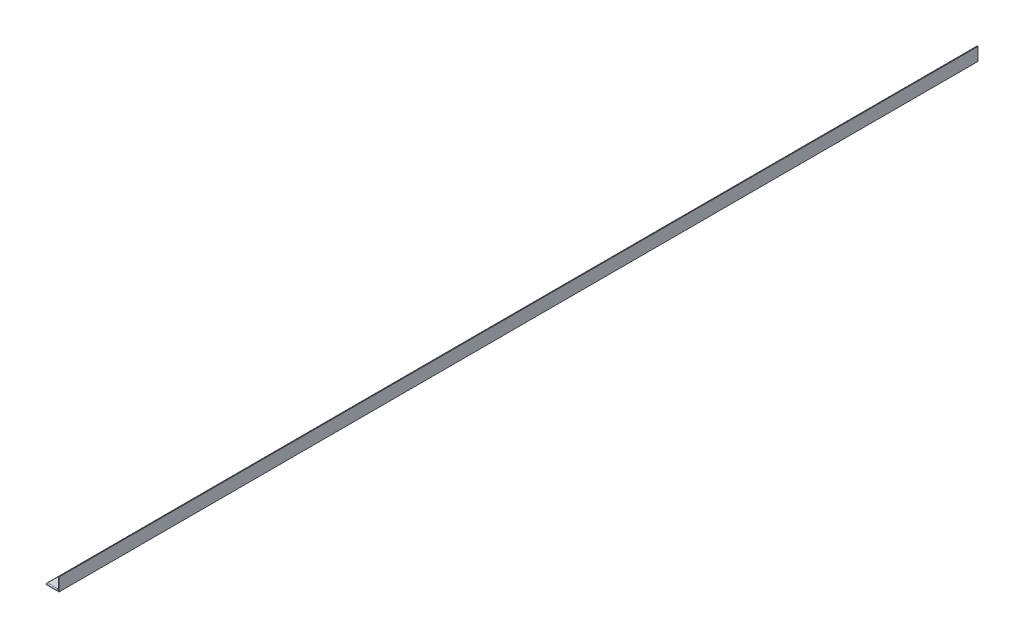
ISO-10303-21;
HEADER;
FILE_DESCRIPTION(('STEP AP214'),'2;1');
FILE_NAME('part.step','',(''),(''),'','','');
FILE_SCHEMA(('AUTOMOTIVE_DESIGN { 1 0 10303 214 1 1 1 1 }'));
ENDSEC;
DATA;
#1=APPLICATION_CONTEXT('core data for automotive mechanical design processes');
#2=APPLICATION_PROTOCOL_DEFINITION('international standard','automotive_design',2000,#1);
#3=PRODUCT_CONTEXT('',#1,'mechanical');
#4=PRODUCT('Part','Part','',(#3));
#5=PRODUCT_RELATED_PRODUCT_CATEGORY('part','',(#4));
#6=PRODUCT_DEFINITION_FORMATION('','',#4);
#7=PRODUCT_DEFINITION_CONTEXT('part definition',#1,'design');
#8=PRODUCT_DEFINITION('design','',#6,#7);
#9=PRODUCT_DEFINITION_SHAPE('','',#8);
#10=(LENGTH_UNIT() NAMED_UNIT(*) SI_UNIT(.MILLI.,.METRE.));
#11=(NAMED_UNIT(*) PLANE_ANGLE_UNIT() SI_UNIT($,.RADIAN.));
#12=(NAMED_UNIT(*) SI_UNIT($,.STERADIAN.) SOLID_ANGLE_UNIT());
#13=UNCERTAINTY_MEASURE_WITH_UNIT(LENGTH_MEASURE(1.E-05),#10,'distance_accuracy_value','');
#14=(GEOMETRIC_REPRESENTATION_CONTEXT(3) GLOBAL_UNCERTAINTY_ASSIGNED_CONTEXT((#13)) GLOBAL_UNIT_ASSIGNED_CONTEXT((#10,
#11,#12)) REPRESENTATION_CONTEXT('',''));
#15=CARTESIAN_POINT('',(0.,0.,0.));
#16=DIRECTION('',(0.,0.,1.));
#17=DIRECTION('',(1.,0.,0.));
#18=AXIS2_PLACEMENT_3D('',#15,#16,#17);
#19=CARTESIAN_POINT('',(0.,30.,2110.));
#20=DIRECTION('',(-1.,0.,0.));
#21=DIRECTION('',(0.,-1.,0.));
#22=AXIS2_PLACEMENT_3D('',#19,#20,#21);
#23=PLANE('',#22);
#24=DIRECTION('',(0.,1.,0.));
#25=VECTOR('',#24,1.);
#26=CARTESIAN_POINT('',(0.,30.,0.));
#27=LINE('',#26,#25);
#28=CARTESIAN_POINT('',(0.,0.,0.));
#29=VERTEX_POINT('',#28);
#30=CARTESIAN_POINT('',(0.,30.,0.));
#31=VERTEX_POINT('',#30);
#32=EDGE_CURVE('E176',#29,#31,#27,.T.);
#33=ORIENTED_EDGE('',*,*,#32,.T.);
#34=DIRECTION('',(0.,0.,-1.));
#35=VECTOR('',#34,1.);
#36=CARTESIAN_POINT('',(0.,30.,2110.));
#37=LINE('',#36,#35);
#38=CARTESIAN_POINT('',(0.,30.,2110.));
#39=VERTEX_POINT('',#38);
#40=EDGE_CURVE('E156',#39,#31,#37,.T.);
#41=ORIENTED_EDGE('',*,*,#40,.F.);
#42=DIRECTION('',(0.,1.,0.));
#43=VECTOR('',#42,1.);
#44=CARTESIAN_POINT('',(0.,30.,2110.));
#45=LINE('',#44,#43);
#46=CARTESIAN_POINT('',(0.,0.,2110.));
#47=VERTEX_POINT('',#46);
#48=EDGE_CURVE('E163',#47,#39,#45,.T.);
#49=ORIENTED_EDGE('',*,*,#48,.F.);
#50=DIRECTION('',(0.,0.,-1.));
#51=VECTOR('',#50,1.);
#52=CARTESIAN_POINT('',(0.,0.,2110.));
#53=LINE('',#52,#51);
#54=EDGE_CURVE('E188',#47,#29,#53,.T.);
#55=ORIENTED_EDGE('',*,*,#54,.T.);
#56=EDGE_LOOP('',(#33,#41,#49,#55));
#57=FACE_BOUND('',#56,.T.);
#58=ADVANCED_FACE('F45',(#57),#23,.F.);
#59=CARTESIAN_POINT('',(-3.,30.,2110.));
#60=DIRECTION('',(0.,-1.,0.));
#61=DIRECTION('',(1.,0.,0.));
#62=AXIS2_PLACEMENT_3D('',#59,#60,#61);
#63=PLANE('',#62);
#64=DIRECTION('',(-1.,0.,0.));
#65=VECTOR('',#64,1.);
#66=CARTESIAN_POINT('',(-3.,30.,0.));
#67=LINE('',#66,#65);
#68=CARTESIAN_POINT('',(-1.,30.,0.));
#69=VERTEX_POINT('',#68);
#70=EDGE_CURVE('E272',#31,#69,#67,.T.);
#71=ORIENTED_EDGE('',*,*,#70,.T.);
#72=DIRECTION('',(0.,0.,-1.));
#73=VECTOR('',#72,1.);
#74=CARTESIAN_POINT('',(-1.,30.,2110.));
#75=LINE('',#74,#73);
#76=CARTESIAN_POINT('',(-1.,30.,2110.));
#77=VERTEX_POINT('',#76);
#78=EDGE_CURVE('E55',#69,#77,#75,.F.);
#79=ORIENTED_EDGE('',*,*,#78,.T.);
#80=DIRECTION('',(-1.,0.,0.));
#81=VECTOR('',#80,1.);
#82=CARTESIAN_POINT('',(-3.,30.,2110.));
#83=LINE('',#82,#81);
#84=EDGE_CURVE('E151',#39,#77,#83,.T.);
#85=ORIENTED_EDGE('',*,*,#84,.F.);
#86=ORIENTED_EDGE('',*,*,#40,.T.);
#87=EDGE_LOOP('',(#71,#79,#85,#86));
#88=FACE_BOUND('',#87,.T.);
#89=ADVANCED_FACE('F154',(#88),#63,.F.);
#90=CARTESIAN_POINT('',(-3.,3.,2110.));
#91=DIRECTION('',(1.,0.,0.));
#92=DIRECTION('',(0.,1.,0.));
#93=AXIS2_PLACEMENT_3D('',#90,#91,#92);
#94=PLANE('',#93);
#95=DIRECTION('',(0.,-1.,0.));
#96=VECTOR('',#95,1.);
#97=CARTESIAN_POINT('',(-3.,3.,2108.));
#98=LINE('',#97,#96);
#99=CARTESIAN_POINT('',(-3.,5.,2108.));
#100=VERTEX_POINT('',#99);
#101=CARTESIAN_POINT('',(-3.,28.,2108.));
#102=VERTEX_POINT('',#101);
#103=EDGE_CURVE('E66',#100,#102,#98,.F.);
#104=ORIENTED_EDGE('',*,*,#103,.T.);
#105=DIRECTION('',(0.,0.,-1.));
#106=VECTOR('',#105,1.);
#107=CARTESIAN_POINT('',(-3.,28.,2110.));
#108=LINE('',#107,#106);
#109=CARTESIAN_POINT('',(-3.,28.,1.99999999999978));
#110=VERTEX_POINT('',#109);
#111=EDGE_CURVE('E228',#102,#110,#108,.T.);
#112=ORIENTED_EDGE('',*,*,#111,.T.);
#113=DIRECTION('',(0.,-1.,0.));
#114=VECTOR('',#113,1.);
#115=CARTESIAN_POINT('',(-3.,3.,1.99999999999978));
#116=LINE('',#115,#114);
#117=CARTESIAN_POINT('',(-3.,5.,1.99999999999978));
#118=VERTEX_POINT('',#117);
#119=EDGE_CURVE('E221',#110,#118,#116,.T.);
#120=ORIENTED_EDGE('',*,*,#119,.T.);
#121=DIRECTION('',(0.,0.,-1.));
#122=VECTOR('',#121,1.);
#123=CARTESIAN_POINT('',(-3.,5.,2110.));
#124=LINE('',#123,#122);
#125=EDGE_CURVE('E74',#118,#100,#124,.F.);
#126=ORIENTED_EDGE('',*,*,#125,.T.);
#127=EDGE_LOOP('',(#104,#112,#120,#126));
#128=FACE_BOUND('',#127,.T.);
#129=ADVANCED_FACE('F329',(#128),#94,.F.);
#130=CARTESIAN_POINT('',(-30.,3.,2110.));
#131=DIRECTION('',(0.,-1.,0.));
#132=DIRECTION('',(0.,0.,-1.));
#133=AXIS2_PLACEMENT_3D('',#130,#131,#132);
#134=PLANE('',#133);
#135=DIRECTION('',(-1.,0.,0.));
#136=VECTOR('',#135,1.);
#137=CARTESIAN_POINT('',(-30.,3.,2108.));
#138=LINE('',#137,#136);
#139=CARTESIAN_POINT('',(-28.,3.,2108.));
#140=VERTEX_POINT('',#139);
#141=CARTESIAN_POINT('',(-5.,3.,2108.));
#142=VERTEX_POINT('',#141);
#143=EDGE_CURVE('E204',#140,#142,#138,.F.);
#144=ORIENTED_EDGE('',*,*,#143,.T.);
#145=DIRECTION('',(0.,0.,-1.));
#146=VECTOR('',#145,1.);
#147=CARTESIAN_POINT('',(-5.,3.,0.));
#148=LINE('',#147,#146);
#149=CARTESIAN_POINT('',(-5.,3.,1.99999999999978));
#150=VERTEX_POINT('',#149);
#151=EDGE_CURVE('E208',#142,#150,#148,.T.);
#152=ORIENTED_EDGE('',*,*,#151,.T.);
#153=DIRECTION('',(-1.,0.,0.));
#154=VECTOR('',#153,1.);
#155=CARTESIAN_POINT('',(-30.,3.,1.99999999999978));
#156=LINE('',#155,#154);
#157=CARTESIAN_POINT('',(-28.,3.,1.99999999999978));
#158=VERTEX_POINT('',#157);
#159=EDGE_CURVE('E201',#150,#158,#156,.T.);
#160=ORIENTED_EDGE('',*,*,#159,.T.);
#161=DIRECTION('',(0.,0.,-1.));
#162=VECTOR('',#161,1.);
#163=CARTESIAN_POINT('',(-28.,3.,2110.));
#164=LINE('',#163,#162);
#165=EDGE_CURVE('E198',#158,#140,#164,.F.);
#166=ORIENTED_EDGE('',*,*,#165,.T.);
#167=EDGE_LOOP('',(#144,#152,#160,#166));
#168=FACE_BOUND('',#167,.T.);
#169=ADVANCED_FACE('F327',(#168),#134,.F.);
#170=CARTESIAN_POINT('',(-30.,0.,2110.));
#171=DIRECTION('',(1.,0.,0.));
#172=DIRECTION('',(0.,0.,-1.));
#173=AXIS2_PLACEMENT_3D('',#170,#171,#172);
#174=PLANE('',#173);
#175=DIRECTION('',(0.,-1.,0.));
#176=VECTOR('',#175,1.);
#177=CARTESIAN_POINT('',(-30.,0.,2110.));
#178=LINE('',#177,#176);
#179=CARTESIAN_POINT('',(-30.,0.999999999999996,2110.));
#180=VERTEX_POINT('',#179);
#181=CARTESIAN_POINT('',(-30.,0.,2110.));
#182=VERTEX_POINT('',#181);
#183=EDGE_CURVE('E162',#180,#182,#178,.T.);
#184=ORIENTED_EDGE('',*,*,#183,.F.);
#185=DIRECTION('',(0.,0.,-1.));
#186=VECTOR('',#185,1.);
#187=CARTESIAN_POINT('',(-30.,0.999999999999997,2110.));
#188=LINE('',#187,#186);
#189=CARTESIAN_POINT('',(-30.,0.999999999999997,0.));
#190=VERTEX_POINT('',#189);
#191=EDGE_CURVE('E11',#180,#190,#188,.T.);
#192=ORIENTED_EDGE('',*,*,#191,.T.);
#193=DIRECTION('',(0.,-1.,0.));
#194=VECTOR('',#193,1.);
#195=CARTESIAN_POINT('',(-30.,0.,0.));
#196=LINE('',#195,#194);
#197=CARTESIAN_POINT('',(-30.,0.,0.));
#198=VERTEX_POINT('',#197);
#199=EDGE_CURVE('E275',#190,#198,#196,.T.);
#200=ORIENTED_EDGE('',*,*,#199,.T.);
#201=DIRECTION('',(0.,0.,-1.));
#202=VECTOR('',#201,1.);
#203=CARTESIAN_POINT('',(-30.,0.,2110.));
#204=LINE('',#203,#202);
#205=EDGE_CURVE('E179',#182,#198,#204,.T.);
#206=ORIENTED_EDGE('',*,*,#205,.F.);
#207=EDGE_LOOP('',(#184,#192,#200,#206));
#208=FACE_BOUND('',#207,.T.);
#209=ADVANCED_FACE('F290',(#208),#174,.F.);
#210=CARTESIAN_POINT('',(0.,0.,2110.));
#211=DIRECTION('',(0.,1.,0.));
#212=DIRECTION('',(-1.,0.,0.));
#213=AXIS2_PLACEMENT_3D('',#210,#211,#212);
#214=PLANE('',#213);
#215=DIRECTION('',(1.,0.,0.));
#216=VECTOR('',#215,1.);
#217=CARTESIAN_POINT('',(0.,0.,0.));
#218=LINE('',#217,#216);
#219=EDGE_CURVE('E173',#198,#29,#218,.T.);
#220=ORIENTED_EDGE('',*,*,#219,.T.);
#221=ORIENTED_EDGE('',*,*,#54,.F.);
#222=DIRECTION('',(1.,0.,0.));
#223=VECTOR('',#222,1.);
#224=CARTESIAN_POINT('',(0.,0.,2110.));
#225=LINE('',#224,#223);
#226=EDGE_CURVE('E168',#182,#47,#225,.T.);
#227=ORIENTED_EDGE('',*,*,#226,.F.);
#228=ORIENTED_EDGE('',*,*,#205,.T.);
#229=EDGE_LOOP('',(#220,#221,#227,#228));
#230=FACE_BOUND('',#229,.T.);
#231=ADVANCED_FACE('F294',(#230),#214,.F.);
#232=CARTESIAN_POINT('',(0.,0.,2110.));
#233=DIRECTION('',(0.,0.,-1.));
#234=DIRECTION('',(-1.,0.,0.));
#235=AXIS2_PLACEMENT_3D('',#232,#233,#234);
#236=PLANE('',#235);
#237=CARTESIAN_POINT('',(-5.,5.,2110.));
#238=DIRECTION('',(0.,0.,-1.));
#239=DIRECTION('',(-1.,0.,0.));
#240=AXIS2_PLACEMENT_3D('',#237,#238,#239);
#241=CIRCLE('',#240,4.);
#242=CARTESIAN_POINT('',(-5.,0.999999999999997,2110.));
#243=VERTEX_POINT('',#242);
#244=CARTESIAN_POINT('',(-0.999999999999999,5.,2110.));
#245=VERTEX_POINT('',#244);
#246=EDGE_CURVE('E178',#243,#245,#241,.F.);
#247=ORIENTED_EDGE('',*,*,#246,.F.);
#248=DIRECTION('',(-1.,0.,0.));
#249=VECTOR('',#248,1.);
#250=CARTESIAN_POINT('',(0.,0.999999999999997,2110.));
#251=LINE('',#250,#249);
#252=EDGE_CURVE('E194',#243,#180,#251,.T.);
#253=ORIENTED_EDGE('',*,*,#252,.T.);
#254=ORIENTED_EDGE('',*,*,#183,.T.);
#255=ORIENTED_EDGE('',*,*,#226,.T.);
#256=ORIENTED_EDGE('',*,*,#48,.T.);
#257=ORIENTED_EDGE('',*,*,#84,.T.);
#258=DIRECTION('',(0.,-1.,0.));
#259=VECTOR('',#258,1.);
#260=CARTESIAN_POINT('',(-0.999999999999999,0.,2110.));
#261=LINE('',#260,#259);
#262=EDGE_CURVE('E184',#77,#245,#261,.T.);
#263=ORIENTED_EDGE('',*,*,#262,.T.);
#264=EDGE_LOOP('',(#247,#253,#254,#255,#256,#257,#263));
#265=FACE_BOUND('',#264,.T.);
#266=ADVANCED_FACE('F166',(#265),#236,.F.);
#267=CARTESIAN_POINT('',(0.,0.,0.));
#268=DIRECTION('',(0.,0.,-1.));
#269=DIRECTION('',(-1.,0.,0.));
#270=AXIS2_PLACEMENT_3D('',#267,#268,#269);
#271=PLANE('',#270);
#272=ORIENTED_EDGE('',*,*,#199,.F.);
#273=DIRECTION('',(-1.,0.,0.));
#274=VECTOR('',#273,1.);
#275=CARTESIAN_POINT('',(-3.,0.999999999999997,0.));
#276=LINE('',#275,#274);
#277=CARTESIAN_POINT('',(-5.,0.999999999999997,0.));
#278=VERTEX_POINT('',#277);
#279=EDGE_CURVE('E218',#190,#278,#276,.F.);
#280=ORIENTED_EDGE('',*,*,#279,.T.);
#281=CARTESIAN_POINT('',(-5.,5.,0.));
#282=DIRECTION('',(0.,0.,-1.));
#283=DIRECTION('',(-1.,0.,0.));
#284=AXIS2_PLACEMENT_3D('',#281,#282,#283);
#285=CIRCLE('',#284,4.);
#286=CARTESIAN_POINT('',(-0.999999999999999,5.,0.));
#287=VERTEX_POINT('',#286);
#288=EDGE_CURVE('E214',#287,#278,#285,.T.);
#289=ORIENTED_EDGE('',*,*,#288,.F.);
#290=DIRECTION('',(0.,-1.,0.));
#291=VECTOR('',#290,1.);
#292=CARTESIAN_POINT('',(-1.,30.,0.));
#293=LINE('',#292,#291);
#294=EDGE_CURVE('E211',#287,#69,#293,.F.);
#295=ORIENTED_EDGE('',*,*,#294,.T.);
#296=ORIENTED_EDGE('',*,*,#70,.F.);
#297=ORIENTED_EDGE('',*,*,#32,.F.);
#298=ORIENTED_EDGE('',*,*,#219,.F.);
#299=EDGE_LOOP('',(#272,#280,#289,#295,#296,#297,#298));
#300=FACE_BOUND('',#299,.T.);
#301=ADVANCED_FACE('F296',(#300),#271,.T.);
#302=CARTESIAN_POINT('',(-0.999999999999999,3.,1.99999999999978));
#303=DIRECTION('',(0.,1.,0.));
#304=DIRECTION('',(-1.,0.,0.));
#305=AXIS2_PLACEMENT_3D('',#302,#303,#304);
#306=CYLINDRICAL_SURFACE('',#305,2.);
#307=CARTESIAN_POINT('',(-0.999999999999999,5.,1.99999999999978));
#308=DIRECTION('',(0.,-1.,0.));
#309=DIRECTION('',(0.,0.,-1.));
#310=AXIS2_PLACEMENT_3D('',#307,#308,#309);
#311=CIRCLE('',#310,2.);
#312=EDGE_CURVE('E261',#118,#287,#311,.T.);
#313=ORIENTED_EDGE('',*,*,#312,.F.);
#314=ORIENTED_EDGE('',*,*,#119,.F.);
#315=CARTESIAN_POINT('',(-1.,28.,1.99999999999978));
#316=DIRECTION('',(0.,0.707106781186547,0.707106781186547));
#317=DIRECTION('',(0.,0.707106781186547,-0.707106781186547));
#318=AXIS2_PLACEMENT_3D('',#315,#316,#317);
#319=ELLIPSE('',#318,2.82842712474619,2.);
#320=EDGE_CURVE('E49',#69,#110,#319,.T.);
#321=ORIENTED_EDGE('',*,*,#320,.F.);
#322=ORIENTED_EDGE('',*,*,#294,.F.);
#323=EDGE_LOOP('',(#313,#314,#321,#322));
#324=FACE_BOUND('',#323,.T.);
#325=ADVANCED_FACE('F47',(#324),#306,.T.);
#326=CARTESIAN_POINT('',(-1.,28.,2110.));
#327=DIRECTION('',(0.,0.,-1.));
#328=DIRECTION('',(-1.,0.,0.));
#329=AXIS2_PLACEMENT_3D('',#326,#327,#328);
#330=CYLINDRICAL_SURFACE('',#329,2.);
#331=ORIENTED_EDGE('',*,*,#320,.T.);
#332=ORIENTED_EDGE('',*,*,#111,.F.);
#333=CARTESIAN_POINT('',(-1.,28.,2108.));
#334=DIRECTION('',(0.,-0.707106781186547,0.707106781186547));
#335=DIRECTION('',(0.,-0.707106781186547,-0.707106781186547));
#336=AXIS2_PLACEMENT_3D('',#333,#334,#335);
#337=ELLIPSE('',#336,2.82842712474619,2.);
#338=EDGE_CURVE('E254',#77,#102,#337,.T.);
#339=ORIENTED_EDGE('',*,*,#338,.F.);
#340=ORIENTED_EDGE('',*,*,#78,.F.);
#341=EDGE_LOOP('',(#331,#332,#339,#340));
#342=FACE_BOUND('',#341,.T.);
#343=ADVANCED_FACE('F300',(#342),#330,.T.);
#344=CARTESIAN_POINT('',(-5.,5.,1.99999999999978));
#345=DIRECTION('',(0.,0.,-1.));
#346=DIRECTION('',(-1.,0.,0.));
#347=AXIS2_PLACEMENT_3D('',#344,#345,#346);
#348=TOROIDAL_SURFACE('',#347,4.,2.);
#349=CARTESIAN_POINT('',(-5.,0.999999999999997,2.));
#350=DIRECTION('',(1.,0.,0.));
#351=DIRECTION('',(0.,0.,-1.));
#352=AXIS2_PLACEMENT_3D('',#349,#350,#351);
#353=CIRCLE('',#352,2.);
#354=EDGE_CURVE('E250',#150,#278,#353,.F.);
#355=ORIENTED_EDGE('',*,*,#354,.F.);
#356=CARTESIAN_POINT('',(-5.,5.,1.99999999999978));
#357=DIRECTION('',(0.,0.,-1.));
#358=DIRECTION('',(-1.,0.,0.));
#359=AXIS2_PLACEMENT_3D('',#356,#357,#358);
#360=CIRCLE('',#359,2.);
#361=EDGE_CURVE('E258',#118,#150,#360,.T.);
#362=ORIENTED_EDGE('',*,*,#361,.F.);
#363=ORIENTED_EDGE('',*,*,#312,.T.);
#364=ORIENTED_EDGE('',*,*,#288,.T.);
#365=EDGE_LOOP('',(#355,#362,#363,#364));
#366=FACE_BOUND('',#365,.T.);
#367=ADVANCED_FACE('F323',(#366),#348,.T.);
#368=CARTESIAN_POINT('',(-5.,5.,2110.));
#369=DIRECTION('',(0.,0.,1.));
#370=DIRECTION('',(1.,0.,0.));
#371=AXIS2_PLACEMENT_3D('',#368,#369,#370);
#372=CYLINDRICAL_SURFACE('',#371,2.);
#373=ORIENTED_EDGE('',*,*,#361,.T.);
#374=ORIENTED_EDGE('',*,*,#151,.F.);
#375=CARTESIAN_POINT('',(-5.,5.,2108.));
#376=DIRECTION('',(0.,0.,-1.));
#377=DIRECTION('',(-1.,0.,0.));
#378=AXIS2_PLACEMENT_3D('',#375,#376,#377);
#379=CIRCLE('',#378,2.);
#380=EDGE_CURVE('E246',#100,#142,#379,.T.);
#381=ORIENTED_EDGE('',*,*,#380,.F.);
#382=ORIENTED_EDGE('',*,*,#125,.F.);
#383=EDGE_LOOP('',(#373,#374,#381,#382));
#384=FACE_BOUND('',#383,.T.);
#385=ADVANCED_FACE('F325',(#384),#372,.F.);
#386=CARTESIAN_POINT('',(-0.999999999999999,0.,2108.));
#387=DIRECTION('',(0.,-1.,0.));
#388=DIRECTION('',(1.,0.,0.));
#389=AXIS2_PLACEMENT_3D('',#386,#387,#388);
#390=CYLINDRICAL_SURFACE('',#389,2.);
#391=ORIENTED_EDGE('',*,*,#338,.T.);
#392=ORIENTED_EDGE('',*,*,#103,.F.);
#393=CARTESIAN_POINT('',(-0.999999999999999,5.,2108.));
#394=DIRECTION('',(0.,-1.,0.));
#395=DIRECTION('',(0.,0.,-1.));
#396=AXIS2_PLACEMENT_3D('',#393,#394,#395);
#397=CIRCLE('',#396,2.);
#398=EDGE_CURVE('E242',#245,#100,#397,.T.);
#399=ORIENTED_EDGE('',*,*,#398,.F.);
#400=ORIENTED_EDGE('',*,*,#262,.F.);
#401=EDGE_LOOP('',(#391,#392,#399,#400));
#402=FACE_BOUND('',#401,.T.);
#403=ADVANCED_FACE('F304',(#402),#390,.T.);
#404=CARTESIAN_POINT('',(-30.,0.999999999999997,1.99999999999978));
#405=DIRECTION('',(1.,0.,0.));
#406=DIRECTION('',(0.,0.,-1.));
#407=AXIS2_PLACEMENT_3D('',#404,#405,#406);
#408=CYLINDRICAL_SURFACE('',#407,2.);
#409=ORIENTED_EDGE('',*,*,#354,.T.);
#410=ORIENTED_EDGE('',*,*,#279,.F.);
#411=CARTESIAN_POINT('',(-28.,0.999999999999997,1.99999999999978));
#412=DIRECTION('',(0.707106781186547,0.,-0.707106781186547));
#413=DIRECTION('',(-0.707106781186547,0.,-0.707106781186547));
#414=AXIS2_PLACEMENT_3D('',#411,#412,#413);
#415=ELLIPSE('',#414,2.82842712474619,2.);
#416=EDGE_CURVE('E238',#158,#190,#415,.F.);
#417=ORIENTED_EDGE('',*,*,#416,.F.);
#418=ORIENTED_EDGE('',*,*,#159,.F.);
#419=EDGE_LOOP('',(#409,#410,#417,#418));
#420=FACE_BOUND('',#419,.T.);
#421=ADVANCED_FACE('F321',(#420),#408,.T.);
#422=CARTESIAN_POINT('',(-5.,5.,2108.));
#423=DIRECTION('',(0.,0.,-1.));
#424=DIRECTION('',(-1.,0.,0.));
#425=AXIS2_PLACEMENT_3D('',#422,#423,#424);
#426=TOROIDAL_SURFACE('',#425,4.,2.);
#427=ORIENTED_EDGE('',*,*,#398,.T.);
#428=ORIENTED_EDGE('',*,*,#380,.T.);
#429=CARTESIAN_POINT('',(-5.,0.999999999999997,2108.));
#430=DIRECTION('',(1.,0.,0.));
#431=DIRECTION('',(0.,0.,-1.));
#432=AXIS2_PLACEMENT_3D('',#429,#430,#431);
#433=CIRCLE('',#432,2.);
#434=EDGE_CURVE('E235',#243,#142,#433,.F.);
#435=ORIENTED_EDGE('',*,*,#434,.F.);
#436=ORIENTED_EDGE('',*,*,#246,.T.);
#437=EDGE_LOOP('',(#427,#428,#435,#436));
#438=FACE_BOUND('',#437,.T.);
#439=ADVANCED_FACE('F307',(#438),#426,.T.);
#440=CARTESIAN_POINT('',(-28.,0.999999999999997,2110.));
#441=DIRECTION('',(0.,0.,-1.));
#442=DIRECTION('',(-1.,0.,0.));
#443=AXIS2_PLACEMENT_3D('',#440,#441,#442);
#444=CYLINDRICAL_SURFACE('',#443,2.);
#445=ORIENTED_EDGE('',*,*,#416,.T.);
#446=ORIENTED_EDGE('',*,*,#191,.F.);
#447=CARTESIAN_POINT('',(-28.,0.999999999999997,2108.));
#448=DIRECTION('',(-0.707106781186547,0.,-0.707106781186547));
#449=DIRECTION('',(0.707106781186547,0.,-0.707106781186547));
#450=AXIS2_PLACEMENT_3D('',#447,#448,#449);
#451=ELLIPSE('',#450,2.82842712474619,2.);
#452=EDGE_CURVE('E232',#140,#180,#451,.F.);
#453=ORIENTED_EDGE('',*,*,#452,.F.);
#454=ORIENTED_EDGE('',*,*,#165,.F.);
#455=EDGE_LOOP('',(#445,#446,#453,#454));
#456=FACE_BOUND('',#455,.T.);
#457=ADVANCED_FACE('F317',(#456),#444,.T.);
#458=CARTESIAN_POINT('',(0.,0.999999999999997,2108.));
#459=DIRECTION('',(-1.,0.,0.));
#460=DIRECTION('',(0.,0.,1.));
#461=AXIS2_PLACEMENT_3D('',#458,#459,#460);
#462=CYLINDRICAL_SURFACE('',#461,2.);
#463=ORIENTED_EDGE('',*,*,#434,.T.);
#464=ORIENTED_EDGE('',*,*,#143,.F.);
#465=ORIENTED_EDGE('',*,*,#452,.T.);
#466=ORIENTED_EDGE('',*,*,#252,.F.);
#467=EDGE_LOOP('',(#463,#464,#465,#466));
#468=FACE_BOUND('',#467,.T.);
#469=ADVANCED_FACE('F312',(#468),#462,.T.);
#470=CLOSED_SHELL('',(#58,#89,#129,#169,#209,#231,#266,#301,#325,#343,#367,#385,#403,#421,#439,
#457,#469));
#471=MANIFOLD_SOLID_BREP('B2',#470);
#472=ADVANCED_BREP_SHAPE_REPRESENTATION('',(#18,#471),#14);
#473=SHAPE_DEFINITION_REPRESENTATION(#9,#472);
ENDSEC;
END-ISO-10303-21;
